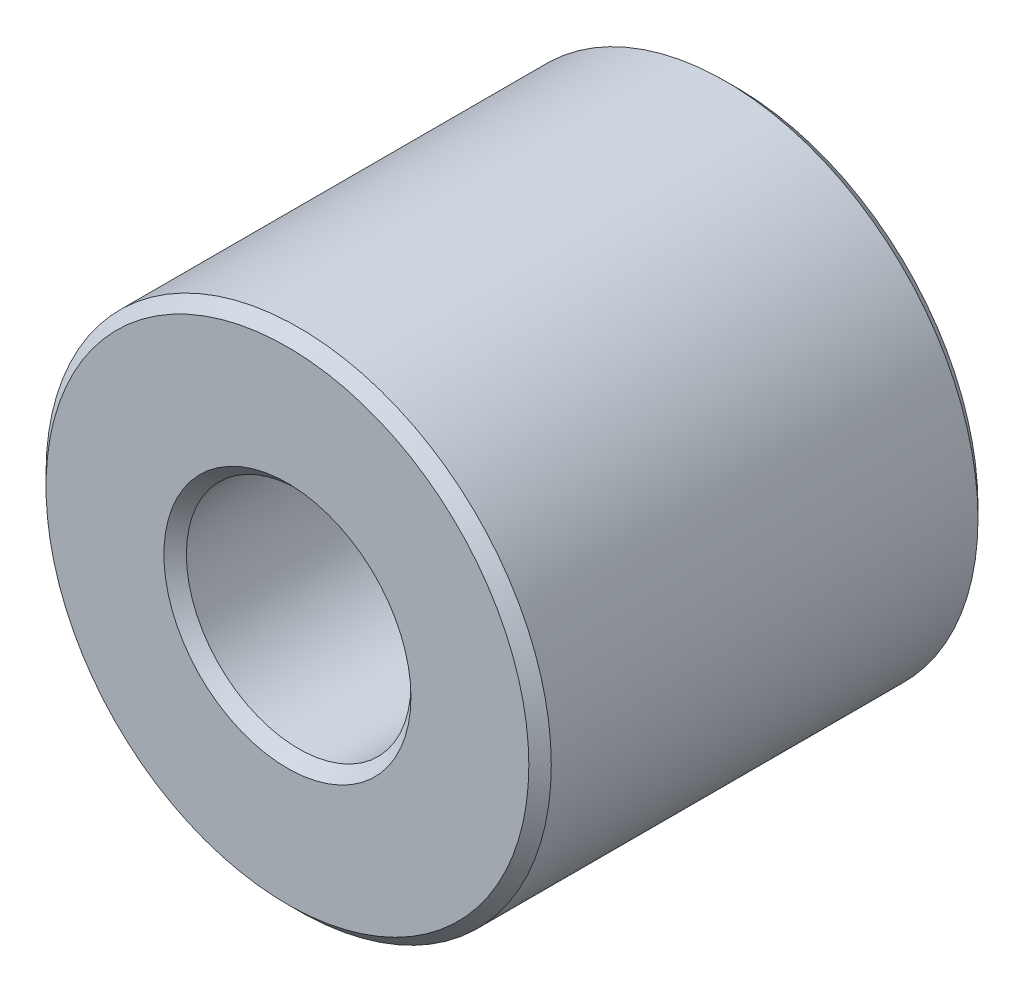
from build123d import *

# Parameters (mm, degrees)
SKETCH1_R           = 9
SKETCH1_R_2         = 4
BOSS_EXTRUDE1_DEPTH = 8
CHAMFER1_SIZE       = 0.4


with BuildPart() as part:
    # Sketch1 → Boss-Extrude1 (new, symmetric)
    with BuildSketch(Plane.XY):
        Circle(SKETCH1_R)
        Circle(SKETCH1_R_2, mode=Mode.SUBTRACT)
    extrude(amount=BOSS_EXTRUDE1_DEPTH, both=True)

    # Chamfer1
    chamfer1_edges = [part.edges().sort_by_distance(p)[0] for p in [
        (-9, 0, -8),
        (-9, 0, 8),
        (-4, 0, -8),
        (-4, 0, 8),
    ]]
    chamfer(chamfer1_edges, length=CHAMFER1_SIZE)


solid = part.part
